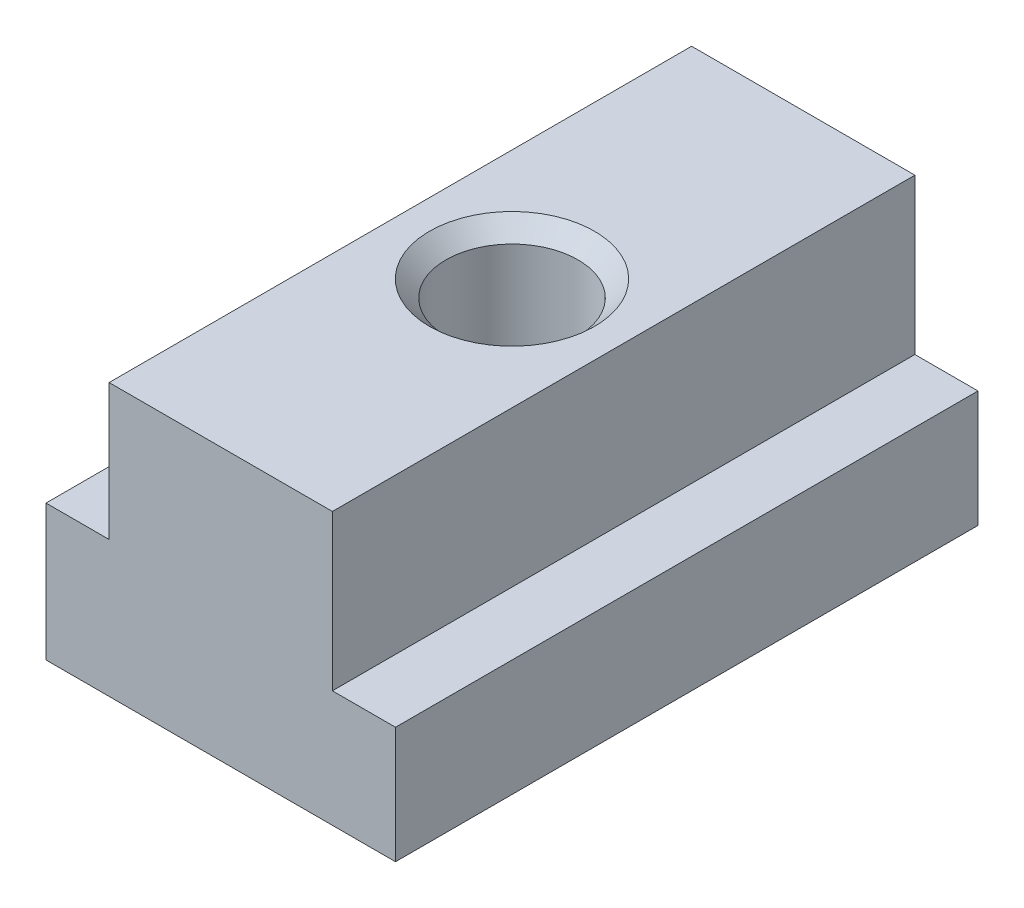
ISO-10303-21;
HEADER;
FILE_DESCRIPTION(('STEP AP214'),'2;1');
FILE_NAME('part.step','',(''),(''),'','','');
FILE_SCHEMA(('AUTOMOTIVE_DESIGN { 1 0 10303 214 1 1 1 1 }'));
ENDSEC;
DATA;
#1=APPLICATION_CONTEXT('core data for automotive mechanical design processes');
#2=APPLICATION_PROTOCOL_DEFINITION('international standard','automotive_design',2000,#1);
#3=PRODUCT_CONTEXT('',#1,'mechanical');
#4=PRODUCT('Part','Part','',(#3));
#5=PRODUCT_RELATED_PRODUCT_CATEGORY('part','',(#4));
#6=PRODUCT_DEFINITION_FORMATION('','',#4);
#7=PRODUCT_DEFINITION_CONTEXT('part definition',#1,'design');
#8=PRODUCT_DEFINITION('design','',#6,#7);
#9=PRODUCT_DEFINITION_SHAPE('','',#8);
#10=(LENGTH_UNIT() NAMED_UNIT(*) SI_UNIT(.MILLI.,.METRE.));
#11=(NAMED_UNIT(*) PLANE_ANGLE_UNIT() SI_UNIT($,.RADIAN.));
#12=(NAMED_UNIT(*) SI_UNIT($,.STERADIAN.) SOLID_ANGLE_UNIT());
#13=UNCERTAINTY_MEASURE_WITH_UNIT(LENGTH_MEASURE(1.E-05),#10,'distance_accuracy_value','');
#14=(GEOMETRIC_REPRESENTATION_CONTEXT(3) GLOBAL_UNCERTAINTY_ASSIGNED_CONTEXT((#13)) GLOBAL_UNIT_ASSIGNED_CONTEXT((#10,
#11,#12)) REPRESENTATION_CONTEXT('',''));
#15=CARTESIAN_POINT('',(0.,0.,0.));
#16=DIRECTION('',(0.,0.,1.));
#17=DIRECTION('',(1.,0.,0.));
#18=AXIS2_PLACEMENT_3D('',#15,#16,#17);
#19=CARTESIAN_POINT('',(14.75,14.,30.));
#20=DIRECTION('',(0.,-1.,0.));
#21=DIRECTION('',(1.,0.,0.));
#22=AXIS2_PLACEMENT_3D('',#19,#20,#21);
#23=PLANE('',#22);
#24=DIRECTION('',(-1.,0.,0.));
#25=VECTOR('',#24,1.);
#26=CARTESIAN_POINT('',(14.75,14.,0.));
#27=LINE('',#26,#25);
#28=CARTESIAN_POINT('',(14.75,14.,0.));
#29=VERTEX_POINT('',#28);
#30=CARTESIAN_POINT('',(3.25,14.,0.));
#31=VERTEX_POINT('',#30);
#32=EDGE_CURVE('E117',#29,#31,#27,.T.);
#33=ORIENTED_EDGE('',*,*,#32,.T.);
#34=DIRECTION('',(0.,0.,-1.));
#35=VECTOR('',#34,1.);
#36=CARTESIAN_POINT('',(3.25,14.,30.));
#37=LINE('',#36,#35);
#38=CARTESIAN_POINT('',(3.25,14.,30.));
#39=VERTEX_POINT('',#38);
#40=EDGE_CURVE('E114',#39,#31,#37,.T.);
#41=ORIENTED_EDGE('',*,*,#40,.F.);
#42=DIRECTION('',(-1.,0.,0.));
#43=VECTOR('',#42,1.);
#44=CARTESIAN_POINT('',(14.75,14.,30.));
#45=LINE('',#44,#43);
#46=CARTESIAN_POINT('',(14.75,14.,30.));
#47=VERTEX_POINT('',#46);
#48=EDGE_CURVE('E103',#47,#39,#45,.T.);
#49=ORIENTED_EDGE('',*,*,#48,.F.);
#50=DIRECTION('',(0.,0.,-1.));
#51=VECTOR('',#50,1.);
#52=CARTESIAN_POINT('',(14.75,14.,30.));
#53=LINE('',#52,#51);
#54=EDGE_CURVE('E118',#47,#29,#53,.T.);
#55=ORIENTED_EDGE('',*,*,#54,.T.);
#56=EDGE_LOOP('',(#33,#41,#49,#55));
#57=FACE_BOUND('',#56,.T.);
#58=CARTESIAN_POINT('',(9.,14.,15.));
#59=DIRECTION('',(0.,1.,0.));
#60=DIRECTION('',(0.,0.,1.));
#61=AXIS2_PLACEMENT_3D('',#58,#59,#60);
#62=CIRCLE('',#61,4.25);
#63=CARTESIAN_POINT('',(9.,14.,19.25));
#64=VERTEX_POINT('',#63);
#65=EDGE_CURVE('E180',#64,#64,#62,.T.);
#66=ORIENTED_EDGE('',*,*,#65,.F.);
#67=EDGE_LOOP('',(#66));
#68=FACE_BOUND('',#67,.T.);
#69=ADVANCED_FACE('F30',(#57,#68),#23,.F.);
#70=CARTESIAN_POINT('',(0.,0.,30.));
#71=DIRECTION('',(1.,0.,0.));
#72=DIRECTION('',(0.,0.,-1.));
#73=AXIS2_PLACEMENT_3D('',#70,#71,#72);
#74=PLANE('',#73);
#75=DIRECTION('',(0.,-1.,0.));
#76=VECTOR('',#75,1.);
#77=CARTESIAN_POINT('',(0.,0.,0.));
#78=LINE('',#77,#76);
#79=CARTESIAN_POINT('',(0.,7.,0.));
#80=VERTEX_POINT('',#79);
#81=CARTESIAN_POINT('',(0.,0.,0.));
#82=VERTEX_POINT('',#81);
#83=EDGE_CURVE('E127',#80,#82,#78,.T.);
#84=ORIENTED_EDGE('',*,*,#83,.T.);
#85=DIRECTION('',(0.,0.,-1.));
#86=VECTOR('',#85,1.);
#87=CARTESIAN_POINT('',(0.,0.,30.));
#88=LINE('',#87,#86);
#89=CARTESIAN_POINT('',(0.,0.,30.));
#90=VERTEX_POINT('',#89);
#91=EDGE_CURVE('E11',#90,#82,#88,.T.);
#92=ORIENTED_EDGE('',*,*,#91,.F.);
#93=DIRECTION('',(0.,-1.,0.));
#94=VECTOR('',#93,1.);
#95=CARTESIAN_POINT('',(0.,0.,30.));
#96=LINE('',#95,#94);
#97=CARTESIAN_POINT('',(0.,7.,30.));
#98=VERTEX_POINT('',#97);
#99=EDGE_CURVE('E142',#98,#90,#96,.T.);
#100=ORIENTED_EDGE('',*,*,#99,.F.);
#101=DIRECTION('',(0.,0.,-1.));
#102=VECTOR('',#101,1.);
#103=CARTESIAN_POINT('',(0.,7.,30.));
#104=LINE('',#103,#102);
#105=EDGE_CURVE('E123',#98,#80,#104,.T.);
#106=ORIENTED_EDGE('',*,*,#105,.T.);
#107=EDGE_LOOP('',(#84,#92,#100,#106));
#108=FACE_BOUND('',#107,.T.);
#109=ADVANCED_FACE('F32',(#108),#74,.F.);
#110=CARTESIAN_POINT('',(0.,0.,30.));
#111=DIRECTION('',(0.,1.,0.));
#112=DIRECTION('',(0.,0.,1.));
#113=AXIS2_PLACEMENT_3D('',#110,#111,#112);
#114=PLANE('',#113);
#115=CARTESIAN_POINT('',(9.,0.,15.));
#116=DIRECTION('',(0.,1.,0.));
#117=DIRECTION('',(0.,0.,1.));
#118=AXIS2_PLACEMENT_3D('',#115,#116,#117);
#119=CIRCLE('',#118,4.25);
#120=CARTESIAN_POINT('',(9.,0.,19.25));
#121=VERTEX_POINT('',#120);
#122=EDGE_CURVE('E183',#121,#121,#119,.T.);
#123=ORIENTED_EDGE('',*,*,#122,.T.);
#124=EDGE_LOOP('',(#123));
#125=FACE_BOUND('',#124,.T.);
#126=DIRECTION('',(1.,0.,0.));
#127=VECTOR('',#126,1.);
#128=CARTESIAN_POINT('',(0.,0.,0.));
#129=LINE('',#128,#127);
#130=CARTESIAN_POINT('',(18.,0.,0.));
#131=VERTEX_POINT('',#130);
#132=EDGE_CURVE('E130',#82,#131,#129,.T.);
#133=ORIENTED_EDGE('',*,*,#132,.T.);
#134=DIRECTION('',(0.,0.,-1.));
#135=VECTOR('',#134,1.);
#136=CARTESIAN_POINT('',(18.,0.,30.));
#137=LINE('',#136,#135);
#138=CARTESIAN_POINT('',(18.,0.,30.));
#139=VERTEX_POINT('',#138);
#140=EDGE_CURVE('E39',#139,#131,#137,.T.);
#141=ORIENTED_EDGE('',*,*,#140,.F.);
#142=DIRECTION('',(1.,0.,0.));
#143=VECTOR('',#142,1.);
#144=CARTESIAN_POINT('',(0.,0.,30.));
#145=LINE('',#144,#143);
#146=EDGE_CURVE('E90',#90,#139,#145,.T.);
#147=ORIENTED_EDGE('',*,*,#146,.F.);
#148=ORIENTED_EDGE('',*,*,#91,.T.);
#149=EDGE_LOOP('',(#133,#141,#147,#148));
#150=FACE_BOUND('',#149,.T.);
#151=ADVANCED_FACE('F187',(#125,#150),#114,.F.);
#152=CARTESIAN_POINT('',(18.,0.,30.));
#153=DIRECTION('',(-1.,0.,0.));
#154=DIRECTION('',(0.,0.,1.));
#155=AXIS2_PLACEMENT_3D('',#152,#153,#154);
#156=PLANE('',#155);
#157=DIRECTION('',(0.,1.,0.));
#158=VECTOR('',#157,1.);
#159=CARTESIAN_POINT('',(18.,0.,0.));
#160=LINE('',#159,#158);
#161=CARTESIAN_POINT('',(18.,6.,0.));
#162=VERTEX_POINT('',#161);
#163=EDGE_CURVE('E133',#131,#162,#160,.T.);
#164=ORIENTED_EDGE('',*,*,#163,.T.);
#165=DIRECTION('',(0.,0.,-1.));
#166=VECTOR('',#165,1.);
#167=CARTESIAN_POINT('',(18.,6.,30.));
#168=LINE('',#167,#166);
#169=CARTESIAN_POINT('',(18.,6.,30.));
#170=VERTEX_POINT('',#169);
#171=EDGE_CURVE('E149',#170,#162,#168,.T.);
#172=ORIENTED_EDGE('',*,*,#171,.F.);
#173=DIRECTION('',(0.,1.,0.));
#174=VECTOR('',#173,1.);
#175=CARTESIAN_POINT('',(18.,0.,30.));
#176=LINE('',#175,#174);
#177=EDGE_CURVE('E157',#139,#170,#176,.T.);
#178=ORIENTED_EDGE('',*,*,#177,.F.);
#179=ORIENTED_EDGE('',*,*,#140,.T.);
#180=EDGE_LOOP('',(#164,#172,#178,#179));
#181=FACE_BOUND('',#180,.T.);
#182=ADVANCED_FACE('F155',(#181),#156,.F.);
#183=CARTESIAN_POINT('',(18.,6.,30.));
#184=DIRECTION('',(0.,-1.,0.));
#185=DIRECTION('',(0.,0.,-1.));
#186=AXIS2_PLACEMENT_3D('',#183,#184,#185);
#187=PLANE('',#186);
#188=DIRECTION('',(-1.,0.,0.));
#189=VECTOR('',#188,1.);
#190=CARTESIAN_POINT('',(18.,6.,0.));
#191=LINE('',#190,#189);
#192=CARTESIAN_POINT('',(14.75,6.,0.));
#193=VERTEX_POINT('',#192);
#194=EDGE_CURVE('E135',#162,#193,#191,.T.);
#195=ORIENTED_EDGE('',*,*,#194,.T.);
#196=DIRECTION('',(0.,0.,-1.));
#197=VECTOR('',#196,1.);
#198=CARTESIAN_POINT('',(14.75,6.,30.));
#199=LINE('',#198,#197);
#200=CARTESIAN_POINT('',(14.75,6.,30.));
#201=VERTEX_POINT('',#200);
#202=EDGE_CURVE('E146',#201,#193,#199,.T.);
#203=ORIENTED_EDGE('',*,*,#202,.F.);
#204=DIRECTION('',(-1.,0.,0.));
#205=VECTOR('',#204,1.);
#206=CARTESIAN_POINT('',(18.,6.,30.));
#207=LINE('',#206,#205);
#208=EDGE_CURVE('E169',#170,#201,#207,.T.);
#209=ORIENTED_EDGE('',*,*,#208,.F.);
#210=ORIENTED_EDGE('',*,*,#171,.T.);
#211=EDGE_LOOP('',(#195,#203,#209,#210));
#212=FACE_BOUND('',#211,.T.);
#213=ADVANCED_FACE('F165',(#212),#187,.F.);
#214=CARTESIAN_POINT('',(14.75,6.,30.));
#215=DIRECTION('',(-1.,0.,0.));
#216=DIRECTION('',(0.,-1.,0.));
#217=AXIS2_PLACEMENT_3D('',#214,#215,#216);
#218=PLANE('',#217);
#219=DIRECTION('',(0.,1.,0.));
#220=VECTOR('',#219,1.);
#221=CARTESIAN_POINT('',(14.75,6.,0.));
#222=LINE('',#221,#220);
#223=EDGE_CURVE('E137',#193,#29,#222,.T.);
#224=ORIENTED_EDGE('',*,*,#223,.T.);
#225=ORIENTED_EDGE('',*,*,#54,.F.);
#226=DIRECTION('',(0.,1.,0.));
#227=VECTOR('',#226,1.);
#228=CARTESIAN_POINT('',(14.75,6.,30.));
#229=LINE('',#228,#227);
#230=EDGE_CURVE('E109',#201,#47,#229,.T.);
#231=ORIENTED_EDGE('',*,*,#230,.F.);
#232=ORIENTED_EDGE('',*,*,#202,.T.);
#233=EDGE_LOOP('',(#224,#225,#231,#232));
#234=FACE_BOUND('',#233,.T.);
#235=ADVANCED_FACE('F168',(#234),#218,.F.);
#236=CARTESIAN_POINT('',(3.25,14.,30.));
#237=DIRECTION('',(1.,0.,0.));
#238=DIRECTION('',(0.,1.,0.));
#239=AXIS2_PLACEMENT_3D('',#236,#237,#238);
#240=PLANE('',#239);
#241=DIRECTION('',(0.,-1.,0.));
#242=VECTOR('',#241,1.);
#243=CARTESIAN_POINT('',(3.25,14.,0.));
#244=LINE('',#243,#242);
#245=CARTESIAN_POINT('',(3.25,7.,0.));
#246=VERTEX_POINT('',#245);
#247=EDGE_CURVE('E76',#31,#246,#244,.T.);
#248=ORIENTED_EDGE('',*,*,#247,.T.);
#249=DIRECTION('',(0.,0.,-1.));
#250=VECTOR('',#249,1.);
#251=CARTESIAN_POINT('',(3.25,7.,30.));
#252=LINE('',#251,#250);
#253=CARTESIAN_POINT('',(3.25,7.,30.));
#254=VERTEX_POINT('',#253);
#255=EDGE_CURVE('E119',#254,#246,#252,.T.);
#256=ORIENTED_EDGE('',*,*,#255,.F.);
#257=DIRECTION('',(0.,-1.,0.));
#258=VECTOR('',#257,1.);
#259=CARTESIAN_POINT('',(3.25,14.,30.));
#260=LINE('',#259,#258);
#261=EDGE_CURVE('E107',#39,#254,#260,.T.);
#262=ORIENTED_EDGE('',*,*,#261,.F.);
#263=ORIENTED_EDGE('',*,*,#40,.T.);
#264=EDGE_LOOP('',(#248,#256,#262,#263));
#265=FACE_BOUND('',#264,.T.);
#266=ADVANCED_FACE('F121',(#265),#240,.F.);
#267=CARTESIAN_POINT('',(0.,7.,30.));
#268=DIRECTION('',(0.,-1.,0.));
#269=DIRECTION('',(0.,0.,-1.));
#270=AXIS2_PLACEMENT_3D('',#267,#268,#269);
#271=PLANE('',#270);
#272=DIRECTION('',(-1.,0.,0.));
#273=VECTOR('',#272,1.);
#274=CARTESIAN_POINT('',(0.,7.,0.));
#275=LINE('',#274,#273);
#276=EDGE_CURVE('E82',#246,#80,#275,.T.);
#277=ORIENTED_EDGE('',*,*,#276,.T.);
#278=ORIENTED_EDGE('',*,*,#105,.F.);
#279=DIRECTION('',(-1.,0.,0.));
#280=VECTOR('',#279,1.);
#281=CARTESIAN_POINT('',(0.,7.,30.));
#282=LINE('',#281,#280);
#283=EDGE_CURVE('E47',#254,#98,#282,.T.);
#284=ORIENTED_EDGE('',*,*,#283,.F.);
#285=ORIENTED_EDGE('',*,*,#255,.T.);
#286=EDGE_LOOP('',(#277,#278,#284,#285));
#287=FACE_BOUND('',#286,.T.);
#288=ADVANCED_FACE('F244',(#287),#271,.F.);
#289=CARTESIAN_POINT('',(0.,7.,30.));
#290=DIRECTION('',(0.,0.,-1.));
#291=DIRECTION('',(-1.,0.,0.));
#292=AXIS2_PLACEMENT_3D('',#289,#290,#291);
#293=PLANE('',#292);
#294=ORIENTED_EDGE('',*,*,#99,.T.);
#295=ORIENTED_EDGE('',*,*,#146,.T.);
#296=ORIENTED_EDGE('',*,*,#177,.T.);
#297=ORIENTED_EDGE('',*,*,#208,.T.);
#298=ORIENTED_EDGE('',*,*,#230,.T.);
#299=ORIENTED_EDGE('',*,*,#48,.T.);
#300=ORIENTED_EDGE('',*,*,#261,.T.);
#301=ORIENTED_EDGE('',*,*,#283,.T.);
#302=EDGE_LOOP('',(#294,#295,#296,#297,#298,#299,#300,#301));
#303=FACE_BOUND('',#302,.T.);
#304=ADVANCED_FACE('F105',(#303),#293,.F.);
#305=CARTESIAN_POINT('',(0.,7.,0.));
#306=DIRECTION('',(0.,0.,-1.));
#307=DIRECTION('',(-1.,0.,0.));
#308=AXIS2_PLACEMENT_3D('',#305,#306,#307);
#309=PLANE('',#308);
#310=ORIENTED_EDGE('',*,*,#83,.F.);
#311=ORIENTED_EDGE('',*,*,#276,.F.);
#312=ORIENTED_EDGE('',*,*,#247,.F.);
#313=ORIENTED_EDGE('',*,*,#32,.F.);
#314=ORIENTED_EDGE('',*,*,#223,.F.);
#315=ORIENTED_EDGE('',*,*,#194,.F.);
#316=ORIENTED_EDGE('',*,*,#163,.F.);
#317=ORIENTED_EDGE('',*,*,#132,.F.);
#318=EDGE_LOOP('',(#310,#311,#312,#313,#314,#315,#316,#317));
#319=FACE_BOUND('',#318,.T.);
#320=ADVANCED_FACE('F161',(#319),#309,.T.);
#321=CARTESIAN_POINT('',(9.,0.850000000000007,15.));
#322=DIRECTION('',(0.,-1.,0.));
#323=DIRECTION('',(0.,0.,-1.));
#324=AXIS2_PLACEMENT_3D('',#321,#322,#323);
#325=CONICAL_SURFACE('',#324,3.4,0.785398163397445);
#326=ORIENTED_EDGE('',*,*,#122,.F.);
#327=EDGE_LOOP('',(#326));
#328=FACE_BOUND('',#327,.T.);
#329=CARTESIAN_POINT('',(9.,0.850000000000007,15.));
#330=DIRECTION('',(0.,1.,0.));
#331=DIRECTION('',(0.,0.,1.));
#332=AXIS2_PLACEMENT_3D('',#329,#330,#331);
#333=CIRCLE('',#332,3.4);
#334=CARTESIAN_POINT('',(9.,0.850000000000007,18.4));
#335=VERTEX_POINT('',#334);
#336=EDGE_CURVE('E131',#335,#335,#333,.T.);
#337=ORIENTED_EDGE('',*,*,#336,.T.);
#338=EDGE_LOOP('',(#337));
#339=FACE_BOUND('',#338,.T.);
#340=ADVANCED_FACE('F189',(#328,#339),#325,.F.);
#341=CARTESIAN_POINT('',(9.,14.,15.));
#342=DIRECTION('',(0.,1.,0.));
#343=DIRECTION('',(0.,0.,1.));
#344=AXIS2_PLACEMENT_3D('',#341,#342,#343);
#345=CYLINDRICAL_SURFACE('',#344,3.4);
#346=ORIENTED_EDGE('',*,*,#336,.F.);
#347=EDGE_LOOP('',(#346));
#348=FACE_BOUND('',#347,.T.);
#349=CARTESIAN_POINT('',(9.,13.15,15.));
#350=DIRECTION('',(0.,1.,0.));
#351=DIRECTION('',(0.,0.,1.));
#352=AXIS2_PLACEMENT_3D('',#349,#350,#351);
#353=CIRCLE('',#352,3.4);
#354=CARTESIAN_POINT('',(9.,13.15,18.4));
#355=VERTEX_POINT('',#354);
#356=EDGE_CURVE('E177',#355,#355,#353,.T.);
#357=ORIENTED_EDGE('',*,*,#356,.T.);
#358=EDGE_LOOP('',(#357));
#359=FACE_BOUND('',#358,.T.);
#360=ADVANCED_FACE('F192',(#348,#359),#345,.F.);
#361=CARTESIAN_POINT('',(9.,14.,15.));
#362=DIRECTION('',(0.,1.,0.));
#363=DIRECTION('',(0.,0.,1.));
#364=AXIS2_PLACEMENT_3D('',#361,#362,#363);
#365=CONICAL_SURFACE('',#364,4.25,0.785398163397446);
#366=ORIENTED_EDGE('',*,*,#356,.F.);
#367=EDGE_LOOP('',(#366));
#368=FACE_BOUND('',#367,.T.);
#369=ORIENTED_EDGE('',*,*,#65,.T.);
#370=EDGE_LOOP('',(#369));
#371=FACE_BOUND('',#370,.T.);
#372=ADVANCED_FACE('F198',(#368,#371),#365,.F.);
#373=CLOSED_SHELL('',(#69,#109,#151,#182,#213,#235,#266,#288,#304,#320,#340,#360,#372));
#374=MANIFOLD_SOLID_BREP('B2',#373);
#375=ADVANCED_BREP_SHAPE_REPRESENTATION('',(#18,#374),#14);
#376=SHAPE_DEFINITION_REPRESENTATION(#9,#375);
ENDSEC;
END-ISO-10303-21;
